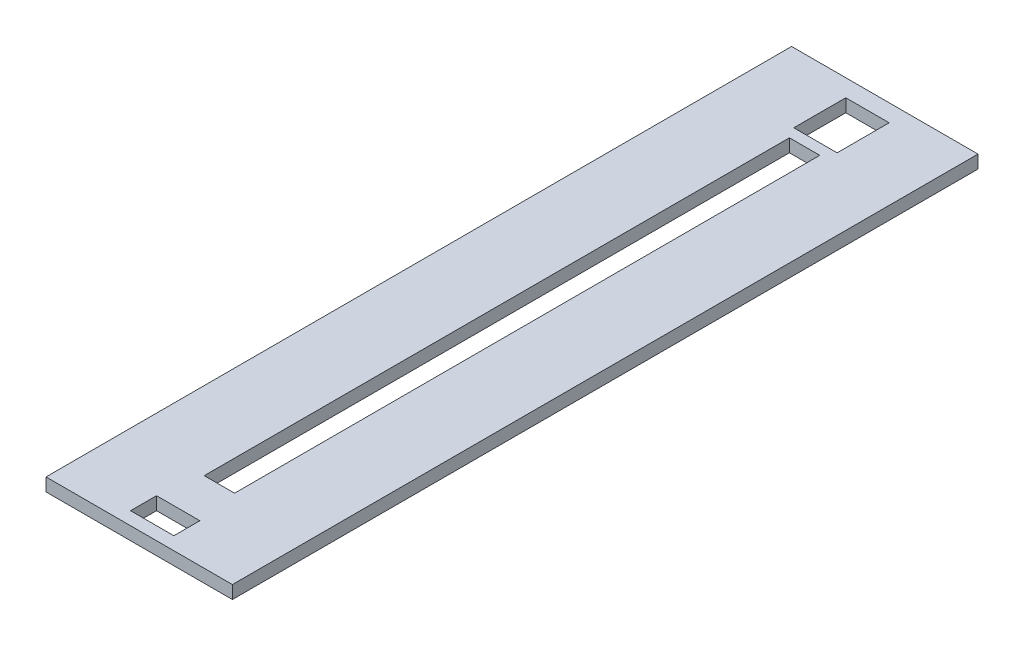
from build123d import *

# Parameters (mm, degrees)
SKETCH1_W           = 43
SKETCH1_H           = 172
SKETCH1_W_2         = 10
SKETCH1_H_2         = 12
SKETCH1_W_3         = 7
SKETCH1_H_3         = 135
SKETCH1_H_4         = 6
BOSS_EXTRUDE1_DEPTH = 3


with BuildPart() as part:
    # Sketch1 → Boss-Extrude1 (new body)
    with BuildSketch(Plane(origin=(0, 0, 0), x_dir=(1, 0, 0), z_dir=(0, 1, 0))):
        Rectangle(SKETCH1_W, SKETCH1_H)
        with Locations((0, 76)):
            Rectangle(SKETCH1_W_2, SKETCH1_H_2, mode=Mode.SUBTRACT)
        Rectangle(SKETCH1_W_3, SKETCH1_H_3, mode=Mode.SUBTRACT)
        with Locations((0, -80)):
            Rectangle(SKETCH1_W_2, SKETCH1_H_4, mode=Mode.SUBTRACT)
    extrude(amount=BOSS_EXTRUDE1_DEPTH)


solid = part.part
